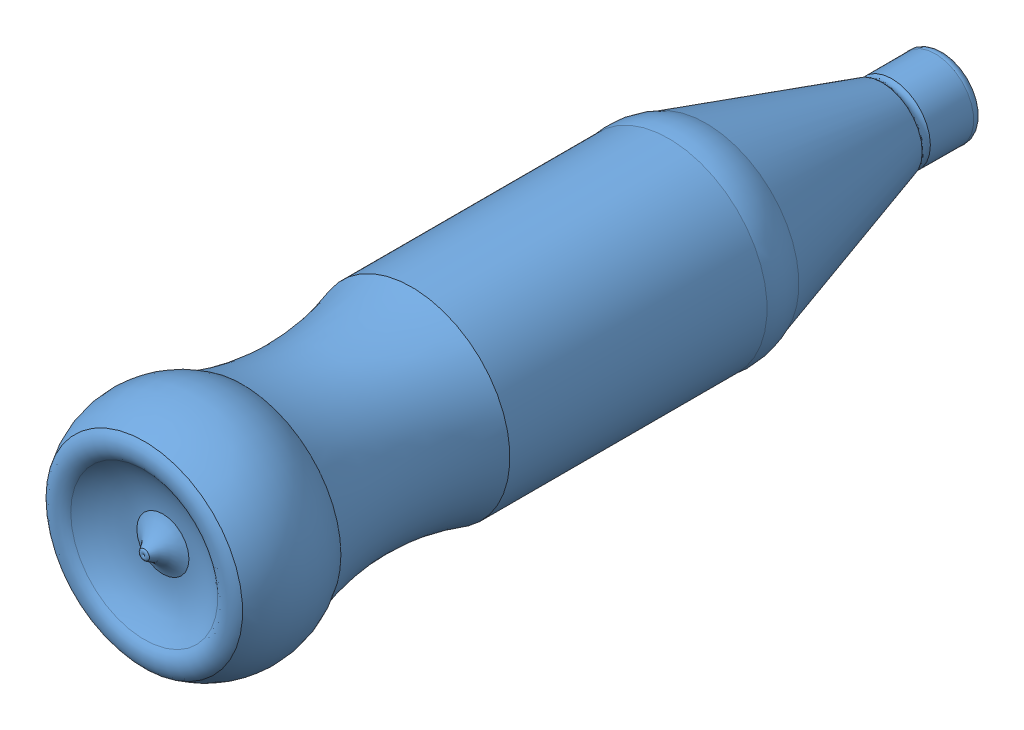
SolidWorks assembly 气瓶口加瓶.SLDASM, configuration 默认 (file format 10000). Lengths in mm.
Overall size (73.86 73.86 261.67).
2 component instances, 2 part files, 2 mates.
Components (placement in the parent):
- 气瓶-1: 气瓶.SLDPRT [默认] at (14.7846 1.5447 244.4562) size (73.86 73.86 261.67)
- 气瓶口-1: 气瓶口.SLDPRT [默认] at (-7.7154 -20.9553 129.8342) x (1 0 0) z (0 -1 0) (suppressed, hidden)
Mates (geometry in assembly coordinates):
- 重合1: coincident anti-aligned: plane of 气瓶-1 through (14.7846 1.5447 130.8342) normal (0 0 -1); plane of 气瓶口-1 through (-7.7154 -20.9553 130.8342) normal (0 0 1)
- 同心1: concentric aligned: circle of 气瓶-1; circle of 气瓶口-1
